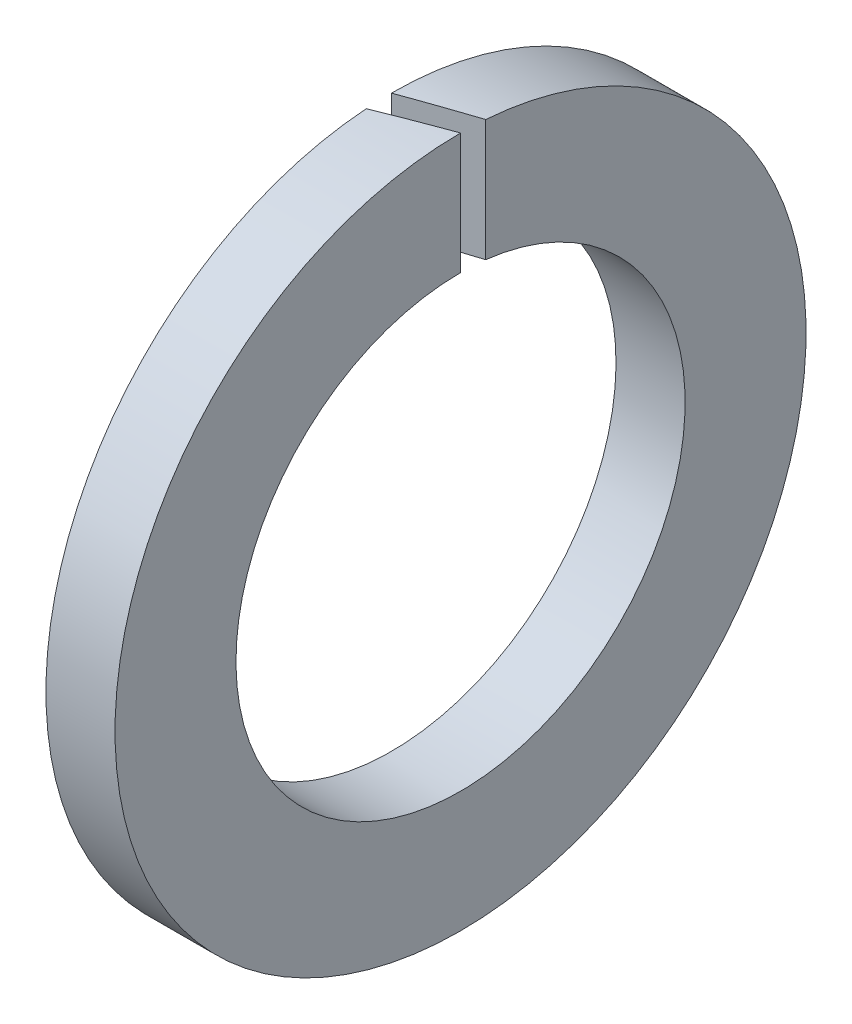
ISO-10303-21;
HEADER;
FILE_DESCRIPTION(('STEP AP214'),'2;1');
FILE_NAME('part.step','',(''),(''),'','','');
FILE_SCHEMA(('AUTOMOTIVE_DESIGN { 1 0 10303 214 1 1 1 1 }'));
ENDSEC;
DATA;
#1=APPLICATION_CONTEXT('core data for automotive mechanical design processes');
#2=APPLICATION_PROTOCOL_DEFINITION('international standard','automotive_design',2000,#1);
#3=PRODUCT_CONTEXT('',#1,'mechanical');
#4=PRODUCT('Part','Part','',(#3));
#5=PRODUCT_RELATED_PRODUCT_CATEGORY('part','',(#4));
#6=PRODUCT_DEFINITION_FORMATION('','',#4);
#7=PRODUCT_DEFINITION_CONTEXT('part definition',#1,'design');
#8=PRODUCT_DEFINITION('design','',#6,#7);
#9=PRODUCT_DEFINITION_SHAPE('','',#8);
#10=(LENGTH_UNIT() NAMED_UNIT(*) SI_UNIT(.MILLI.,.METRE.));
#11=(NAMED_UNIT(*) PLANE_ANGLE_UNIT() SI_UNIT($,.RADIAN.));
#12=(NAMED_UNIT(*) SI_UNIT($,.STERADIAN.) SOLID_ANGLE_UNIT());
#13=UNCERTAINTY_MEASURE_WITH_UNIT(LENGTH_MEASURE(1.E-05),#10,'distance_accuracy_value','');
#14=(GEOMETRIC_REPRESENTATION_CONTEXT(3) GLOBAL_UNCERTAINTY_ASSIGNED_CONTEXT((#13)) GLOBAL_UNIT_ASSIGNED_CONTEXT((#10,
#11,#12)) REPRESENTATION_CONTEXT('',''));
#15=CARTESIAN_POINT('',(0.,0.,0.));
#16=DIRECTION('',(0.,0.,1.));
#17=DIRECTION('',(1.,0.,0.));
#18=AXIS2_PLACEMENT_3D('',#15,#16,#17);
#19=CARTESIAN_POINT('',(0.,0.,-10.));
#20=DIRECTION('',(1.,0.,0.));
#21=DIRECTION('',(0.,0.,-1.));
#22=AXIS2_PLACEMENT_3D('',#19,#20,#21);
#23=PLANE('',#22);
#24=DIRECTION('',(0.,-1.,0.));
#25=VECTOR('',#24,1.);
#26=CARTESIAN_POINT('',(0.,10.,0.727940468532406));
#27=LINE('',#26,#25);
#28=CARTESIAN_POINT('',(0.,9.97346994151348,0.727940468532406));
#29=VERTEX_POINT('',#28);
#30=CARTESIAN_POINT('',(0.,6.45911005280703,0.727940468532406));
#31=VERTEX_POINT('',#30);
#32=EDGE_CURVE('E52',#29,#31,#27,.T.);
#33=ORIENTED_EDGE('',*,*,#32,.T.);
#34=CARTESIAN_POINT('',(0.,0.,0.));
#35=DIRECTION('',(-1.,0.,0.));
#36=DIRECTION('',(0.,0.,1.));
#37=AXIS2_PLACEMENT_3D('',#34,#35,#36);
#38=CIRCLE('',#37,6.5);
#39=CARTESIAN_POINT('',(0.,6.5,0.));
#40=VERTEX_POINT('',#39);
#41=EDGE_CURVE('E86',#40,#31,#38,.T.);
#42=ORIENTED_EDGE('',*,*,#41,.F.);
#43=DIRECTION('',(0.,-1.,0.));
#44=VECTOR('',#43,1.);
#45=CARTESIAN_POINT('',(0.,10.,0.));
#46=LINE('',#45,#44);
#47=CARTESIAN_POINT('',(0.,10.,0.));
#48=VERTEX_POINT('',#47);
#49=EDGE_CURVE('E95',#48,#40,#46,.T.);
#50=ORIENTED_EDGE('',*,*,#49,.F.);
#51=CARTESIAN_POINT('',(0.,0.,0.));
#52=DIRECTION('',(-1.,0.,0.));
#53=DIRECTION('',(0.,0.,1.));
#54=AXIS2_PLACEMENT_3D('',#51,#52,#53);
#55=CIRCLE('',#54,10.);
#56=EDGE_CURVE('E84',#48,#29,#55,.T.);
#57=ORIENTED_EDGE('',*,*,#56,.T.);
#58=EDGE_LOOP('',(#33,#42,#50,#57));
#59=FACE_BOUND('',#58,.T.);
#60=ADVANCED_FACE('F31',(#59),#23,.F.);
#61=CARTESIAN_POINT('',(0.,0.,0.));
#62=DIRECTION('',(-1.,0.,0.));
#63=DIRECTION('',(0.,0.,1.));
#64=AXIS2_PLACEMENT_3D('',#61,#62,#63);
#65=CYLINDRICAL_SURFACE('',#64,6.5);
#66=CARTESIAN_POINT('',(2.,0.,0.));
#67=DIRECTION('',(-0.342020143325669,0.,-0.939692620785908));
#68=DIRECTION('',(-0.939692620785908,0.,0.342020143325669));
#69=AXIS2_PLACEMENT_3D('',#66,#67,#68);
#70=ELLIPSE('',#69,19.00472860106,6.5);
#71=CARTESIAN_POINT('',(2.,6.5,0.));
#72=VERTEX_POINT('',#71);
#73=EDGE_CURVE('E88',#72,#31,#70,.F.);
#74=ORIENTED_EDGE('',*,*,#73,.F.);
#75=CARTESIAN_POINT('',(2.,0.,0.));
#76=DIRECTION('',(-1.,0.,0.));
#77=DIRECTION('',(0.,0.,1.));
#78=AXIS2_PLACEMENT_3D('',#75,#76,#77);
#79=CIRCLE('',#78,6.5);
#80=CARTESIAN_POINT('',(2.,6.45911005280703,-0.727940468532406));
#81=VERTEX_POINT('',#80);
#82=EDGE_CURVE('E81',#81,#72,#79,.T.);
#83=ORIENTED_EDGE('',*,*,#82,.F.);
#84=CARTESIAN_POINT('',(0.,0.,0.));
#85=DIRECTION('',(0.342020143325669,0.,0.939692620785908));
#86=DIRECTION('',(-0.939692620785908,0.,0.342020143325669));
#87=AXIS2_PLACEMENT_3D('',#84,#85,#86);
#88=ELLIPSE('',#87,19.00472860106,6.5);
#89=EDGE_CURVE('E103',#40,#81,#88,.F.);
#90=ORIENTED_EDGE('',*,*,#89,.F.);
#91=ORIENTED_EDGE('',*,*,#41,.T.);
#92=EDGE_LOOP('',(#74,#83,#90,#91));
#93=FACE_BOUND('',#92,.T.);
#94=ADVANCED_FACE('F105',(#93),#65,.F.);
#95=CARTESIAN_POINT('',(2.,0.,-10.));
#96=DIRECTION('',(-1.,0.,0.));
#97=DIRECTION('',(0.,0.,1.));
#98=AXIS2_PLACEMENT_3D('',#95,#96,#97);
#99=PLANE('',#98);
#100=DIRECTION('',(0.,-1.,0.));
#101=VECTOR('',#100,1.);
#102=CARTESIAN_POINT('',(2.,10.,0.));
#103=LINE('',#102,#101);
#104=CARTESIAN_POINT('',(2.,10.,0.));
#105=VERTEX_POINT('',#104);
#106=EDGE_CURVE('E69',#105,#72,#103,.T.);
#107=ORIENTED_EDGE('',*,*,#106,.F.);
#108=CARTESIAN_POINT('',(2.,0.,0.));
#109=DIRECTION('',(-1.,0.,0.));
#110=DIRECTION('',(0.,0.,1.));
#111=AXIS2_PLACEMENT_3D('',#108,#109,#110);
#112=CIRCLE('',#111,10.);
#113=CARTESIAN_POINT('',(2.,9.97346994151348,-0.727940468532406));
#114=VERTEX_POINT('',#113);
#115=EDGE_CURVE('E79',#114,#105,#112,.T.);
#116=ORIENTED_EDGE('',*,*,#115,.F.);
#117=DIRECTION('',(0.,-1.,0.));
#118=VECTOR('',#117,1.);
#119=CARTESIAN_POINT('',(2.,10.,-0.727940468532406));
#120=LINE('',#119,#118);
#121=EDGE_CURVE('E45',#114,#81,#120,.T.);
#122=ORIENTED_EDGE('',*,*,#121,.T.);
#123=ORIENTED_EDGE('',*,*,#82,.T.);
#124=EDGE_LOOP('',(#107,#116,#122,#123));
#125=FACE_BOUND('',#124,.T.);
#126=ADVANCED_FACE('F78',(#125),#99,.F.);
#127=CARTESIAN_POINT('',(0.,0.,0.));
#128=DIRECTION('',(-1.,0.,0.));
#129=DIRECTION('',(0.,0.,1.));
#130=AXIS2_PLACEMENT_3D('',#127,#128,#129);
#131=CYLINDRICAL_SURFACE('',#130,10.);
#132=CARTESIAN_POINT('',(2.,0.,0.));
#133=DIRECTION('',(-0.342020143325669,0.,-0.939692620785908));
#134=DIRECTION('',(-0.939692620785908,0.,0.342020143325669));
#135=AXIS2_PLACEMENT_3D('',#132,#133,#134);
#136=ELLIPSE('',#135,29.2380440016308,10.);
#137=EDGE_CURVE('E11',#29,#105,#136,.T.);
#138=ORIENTED_EDGE('',*,*,#137,.F.);
#139=ORIENTED_EDGE('',*,*,#56,.F.);
#140=CARTESIAN_POINT('',(0.,0.,0.));
#141=DIRECTION('',(0.342020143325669,0.,0.939692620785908));
#142=DIRECTION('',(-0.939692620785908,0.,0.342020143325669));
#143=AXIS2_PLACEMENT_3D('',#140,#141,#142);
#144=ELLIPSE('',#143,29.2380440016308,10.);
#145=EDGE_CURVE('E38',#114,#48,#144,.T.);
#146=ORIENTED_EDGE('',*,*,#145,.F.);
#147=ORIENTED_EDGE('',*,*,#115,.T.);
#148=EDGE_LOOP('',(#138,#139,#146,#147));
#149=FACE_BOUND('',#148,.T.);
#150=ADVANCED_FACE('F83',(#149),#131,.T.);
#151=CARTESIAN_POINT('',(0.,10.,0.));
#152=DIRECTION('',(0.342020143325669,0.,0.939692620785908));
#153=DIRECTION('',(0.939692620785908,0.,-0.342020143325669));
#154=AXIS2_PLACEMENT_3D('',#151,#152,#153);
#155=PLANE('',#154);
#156=ORIENTED_EDGE('',*,*,#89,.T.);
#157=ORIENTED_EDGE('',*,*,#121,.F.);
#158=ORIENTED_EDGE('',*,*,#145,.T.);
#159=ORIENTED_EDGE('',*,*,#49,.T.);
#160=EDGE_LOOP('',(#156,#157,#158,#159));
#161=FACE_BOUND('',#160,.T.);
#162=ADVANCED_FACE('F94',(#161),#155,.T.);
#163=CARTESIAN_POINT('',(2.,10.,0.));
#164=DIRECTION('',(-0.342020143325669,0.,-0.939692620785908));
#165=DIRECTION('',(-0.939692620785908,0.,0.342020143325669));
#166=AXIS2_PLACEMENT_3D('',#163,#164,#165);
#167=PLANE('',#166);
#168=ORIENTED_EDGE('',*,*,#73,.T.);
#169=ORIENTED_EDGE('',*,*,#32,.F.);
#170=ORIENTED_EDGE('',*,*,#137,.T.);
#171=ORIENTED_EDGE('',*,*,#106,.T.);
#172=EDGE_LOOP('',(#168,#169,#170,#171));
#173=FACE_BOUND('',#172,.T.);
#174=ADVANCED_FACE('F68',(#173),#167,.T.);
#175=CLOSED_SHELL('',(#60,#94,#126,#150,#162,#174));
#176=MANIFOLD_SOLID_BREP('B2',#175);
#177=ADVANCED_BREP_SHAPE_REPRESENTATION('',(#18,#176),#14);
#178=SHAPE_DEFINITION_REPRESENTATION(#9,#177);
ENDSEC;
END-ISO-10303-21;
